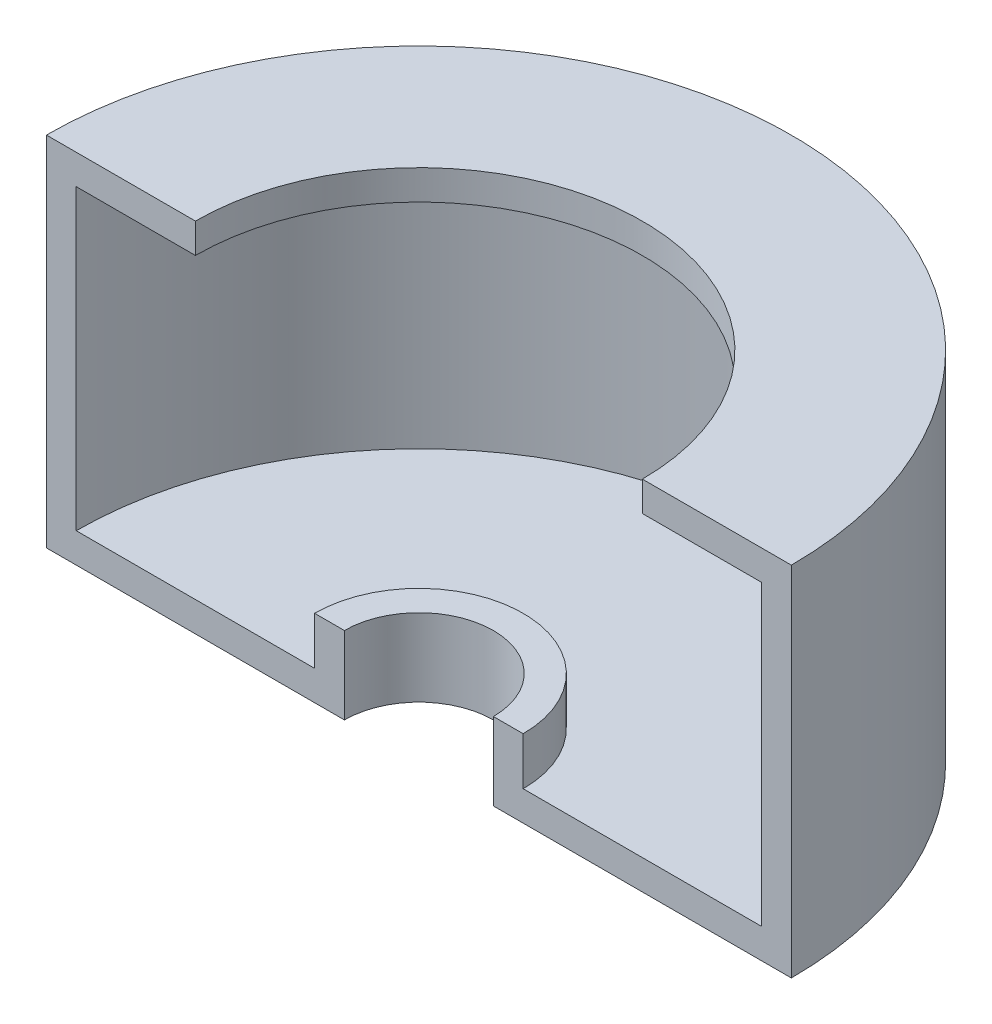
from build123d import *

# Parameters (mm, degrees)
REVOLVE_THIN1_ANGLE = 180


with BuildPart() as part:
    # Sketch1 → Revolve-Thin1 (revolve)
    with BuildSketch(Plane.XY):
        Polygon((37.5, 50), (57.5, 50), (57.5, 0), (17.5, 0), (17.5, 8), (12.5, 8), (12.5, -5), (62.5, -5), (62.5, 55), (37.5, 55), align=None)
    revolve(axis=Axis((0, 53.450352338, 0), (0, 1, 0)), revolution_arc=REVOLVE_THIN1_ANGLE)


solid = part.part
